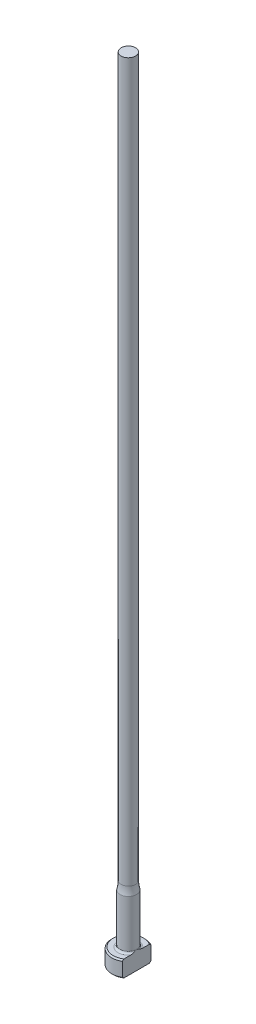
ISO-10303-21;
HEADER;
FILE_DESCRIPTION(('STEP AP214'),'2;1');
FILE_NAME('part.step','',(''),(''),'','','');
FILE_SCHEMA(('AUTOMOTIVE_DESIGN { 1 0 10303 214 1 1 1 1 }'));
ENDSEC;
DATA;
#1=APPLICATION_CONTEXT('core data for automotive mechanical design processes');
#2=APPLICATION_PROTOCOL_DEFINITION('international standard','automotive_design',2000,#1);
#3=PRODUCT_CONTEXT('',#1,'mechanical');
#4=PRODUCT('Part','Part','',(#3));
#5=PRODUCT_RELATED_PRODUCT_CATEGORY('part','',(#4));
#6=PRODUCT_DEFINITION_FORMATION('','',#4);
#7=PRODUCT_DEFINITION_CONTEXT('part definition',#1,'design');
#8=PRODUCT_DEFINITION('design','',#6,#7);
#9=PRODUCT_DEFINITION_SHAPE('','',#8);
#10=(LENGTH_UNIT() NAMED_UNIT(*) SI_UNIT(.MILLI.,.METRE.));
#11=(NAMED_UNIT(*) PLANE_ANGLE_UNIT() SI_UNIT($,.RADIAN.));
#12=(NAMED_UNIT(*) SI_UNIT($,.STERADIAN.) SOLID_ANGLE_UNIT());
#13=UNCERTAINTY_MEASURE_WITH_UNIT(LENGTH_MEASURE(1.E-05),#10,'distance_accuracy_value','');
#14=(GEOMETRIC_REPRESENTATION_CONTEXT(3) GLOBAL_UNCERTAINTY_ASSIGNED_CONTEXT((#13)) GLOBAL_UNIT_ASSIGNED_CONTEXT((#10,
#11,#12)) REPRESENTATION_CONTEXT('',''));
#15=CARTESIAN_POINT('',(0.,0.,0.));
#16=DIRECTION('',(0.,0.,1.));
#17=DIRECTION('',(1.,0.,0.));
#18=AXIS2_PLACEMENT_3D('',#15,#16,#17);
#19=CARTESIAN_POINT('',(-3.17499999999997,3.175,0.));
#20=DIRECTION('',(0.,1.,0.));
#21=DIRECTION('',(0.,0.,1.));
#22=AXIS2_PLACEMENT_3D('',#19,#20,#21);
#23=PLANE('',#22);
#24=CARTESIAN_POINT('',(0.,3.175,0.));
#25=DIRECTION('',(0.,1.,0.));
#26=DIRECTION('',(0.,0.,1.));
#27=AXIS2_PLACEMENT_3D('',#24,#25,#26);
#28=CIRCLE('',#27,2.92099999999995);
#29=CARTESIAN_POINT('',(1.58749999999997,3.175,-2.45195529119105));
#30=VERTEX_POINT('',#29);
#31=CARTESIAN_POINT('',(1.58749999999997,3.175,2.45195529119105));
#32=VERTEX_POINT('',#31);
#33=EDGE_CURVE('E105',#30,#32,#28,.T.);
#34=ORIENTED_EDGE('',*,*,#33,.T.);
#35=DIRECTION('',(0.,0.,1.));
#36=VECTOR('',#35,1.);
#37=CARTESIAN_POINT('',(1.58749999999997,3.17500000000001,2.74963065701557));
#38=LINE('',#37,#36);
#39=CARTESIAN_POINT('',(1.58749999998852,3.175,1.16397422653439));
#40=VERTEX_POINT('',#39);
#41=EDGE_CURVE('E126',#40,#32,#38,.T.);
#42=ORIENTED_EDGE('',*,*,#41,.F.);
#43=CARTESIAN_POINT('',(0.,3.175,0.));
#44=DIRECTION('',(0.,1.,0.));
#45=DIRECTION('',(0.,0.,1.));
#46=AXIS2_PLACEMENT_3D('',#43,#44,#45);
#47=CIRCLE('',#46,1.96849999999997);
#48=CARTESIAN_POINT('',(1.58749999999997,3.175,-1.16397422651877));
#49=VERTEX_POINT('',#48);
#50=EDGE_CURVE('E11',#40,#49,#47,.F.);
#51=ORIENTED_EDGE('',*,*,#50,.T.);
#52=EDGE_CURVE('E52',#30,#49,#38,.T.);
#53=ORIENTED_EDGE('',*,*,#52,.F.);
#54=EDGE_LOOP('',(#34,#42,#51,#53));
#55=FACE_BOUND('',#54,.T.);
#56=ADVANCED_FACE('F32',(#55),#23,.T.);
#57=CARTESIAN_POINT('',(0.,259.958771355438,0.));
#58=DIRECTION('',(0.,1.,0.));
#59=DIRECTION('',(0.,0.,1.));
#60=AXIS2_PLACEMENT_3D('',#57,#58,#59);
#61=CYLINDRICAL_SURFACE('',#60,3.17499999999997);
#62=CARTESIAN_POINT('',(0.,2.92100000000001,0.));
#63=DIRECTION('',(0.,1.,0.));
#64=DIRECTION('',(0.,0.,1.));
#65=AXIS2_PLACEMENT_3D('',#62,#63,#64);
#66=CIRCLE('',#65,3.17499999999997);
#67=CARTESIAN_POINT('',(1.58749999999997,2.92100000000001,2.74963065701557));
#68=VERTEX_POINT('',#67);
#69=CARTESIAN_POINT('',(1.58749999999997,2.92100000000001,-2.74963065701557));
#70=VERTEX_POINT('',#69);
#71=EDGE_CURVE('E98',#68,#70,#66,.F.);
#72=ORIENTED_EDGE('',*,*,#71,.T.);
#73=DIRECTION('',(0.,-1.,0.));
#74=VECTOR('',#73,1.);
#75=CARTESIAN_POINT('',(1.58749999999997,152.401,-2.74963065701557));
#76=LINE('',#75,#74);
#77=CARTESIAN_POINT('',(1.58749999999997,0.254000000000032,-2.74963065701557));
#78=VERTEX_POINT('',#77);
#79=EDGE_CURVE('E141',#70,#78,#76,.T.);
#80=ORIENTED_EDGE('',*,*,#79,.T.);
#81=CARTESIAN_POINT('',(0.,0.254000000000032,0.));
#82=DIRECTION('',(0.,-1.,0.));
#83=DIRECTION('',(0.,0.,-1.));
#84=AXIS2_PLACEMENT_3D('',#81,#82,#83);
#85=CIRCLE('',#84,3.17499999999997);
#86=CARTESIAN_POINT('',(1.58749999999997,0.254000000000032,2.74963065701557));
#87=VERTEX_POINT('',#86);
#88=EDGE_CURVE('E95',#78,#87,#85,.F.);
#89=ORIENTED_EDGE('',*,*,#88,.T.);
#90=DIRECTION('',(0.,-1.,0.));
#91=VECTOR('',#90,1.);
#92=CARTESIAN_POINT('',(1.58749999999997,152.401,2.74963065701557));
#93=LINE('',#92,#91);
#94=EDGE_CURVE('E88',#68,#87,#93,.T.);
#95=ORIENTED_EDGE('',*,*,#94,.F.);
#96=EDGE_LOOP('',(#72,#80,#89,#95));
#97=FACE_BOUND('',#96,.T.);
#98=ADVANCED_FACE('F191',(#97),#61,.T.);
#99=CARTESIAN_POINT('',(0.,0.,0.));
#100=DIRECTION('',(0.,-1.,0.));
#101=DIRECTION('',(0.,0.,-1.));
#102=AXIS2_PLACEMENT_3D('',#99,#100,#101);
#103=PLANE('',#102);
#104=CARTESIAN_POINT('',(0.,0.,0.));
#105=DIRECTION('',(0.,-1.,0.));
#106=DIRECTION('',(0.,0.,-1.));
#107=AXIS2_PLACEMENT_3D('',#104,#105,#106);
#108=CIRCLE('',#107,2.92099999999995);
#109=CARTESIAN_POINT('',(1.58749999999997,0.,2.45195529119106));
#110=VERTEX_POINT('',#109);
#111=CARTESIAN_POINT('',(1.58749999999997,0.,-2.45195529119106));
#112=VERTEX_POINT('',#111);
#113=EDGE_CURVE('E93',#110,#112,#108,.T.);
#114=ORIENTED_EDGE('',*,*,#113,.T.);
#115=DIRECTION('',(0.,0.,1.));
#116=VECTOR('',#115,1.);
#117=CARTESIAN_POINT('',(1.58749999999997,0.,2.74963065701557));
#118=LINE('',#117,#116);
#119=EDGE_CURVE('E78',#112,#110,#118,.T.);
#120=ORIENTED_EDGE('',*,*,#119,.T.);
#121=EDGE_LOOP('',(#114,#120));
#122=FACE_BOUND('',#121,.T.);
#123=ADVANCED_FACE('F97',(#122),#103,.T.);
#124=CARTESIAN_POINT('',(0.,3.17499999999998,0.));
#125=DIRECTION('',(0.,-1.,0.));
#126=DIRECTION('',(0.,0.,-1.));
#127=AXIS2_PLACEMENT_3D('',#124,#125,#126);
#128=CONICAL_SURFACE('',#127,2.92099999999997,0.7853981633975);
#129=ORIENTED_EDGE('',*,*,#71,.F.);
#130=CARTESIAN_POINT('',(1.58749999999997,-0.161620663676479,-6.0529050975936));
#131=CARTESIAN_POINT('',(1.58749999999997,-0.0288893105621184,-5.91567682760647));
#132=CARTESIAN_POINT('',(1.58749999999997,0.103699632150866,-5.77831035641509));
#133=CARTESIAN_POINT('',(1.58749999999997,0.36850839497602,-5.5032187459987));
#134=CARTESIAN_POINT('',(1.58749999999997,0.500728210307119,-5.36549360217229));
#135=CARTESIAN_POINT('',(1.58749999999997,0.764778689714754,-5.08953516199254));
#136=CARTESIAN_POINT('',(1.58749999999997,0.896609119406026,-4.95130164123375));
#137=CARTESIAN_POINT('',(1.58749999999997,1.15968706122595,-4.67428233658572));
#138=CARTESIAN_POINT('',(1.58749999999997,1.29093457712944,-4.53549655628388));
#139=CARTESIAN_POINT('',(1.58749999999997,1.55007705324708,-4.25997724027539));
#140=CARTESIAN_POINT('',(1.58749999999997,1.67798684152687,-4.12325766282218));
#141=CARTESIAN_POINT('',(1.58749999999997,1.93284861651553,-3.84892898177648));
#142=CARTESIAN_POINT('',(1.58749999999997,2.05980060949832,-3.71131988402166));
#143=CARTESIAN_POINT('',(1.58749999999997,2.31237508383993,-3.43493978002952));
#144=CARTESIAN_POINT('',(1.58749999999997,2.43799784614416,-3.29616903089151));
#145=CARTESIAN_POINT('',(1.58749999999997,2.68741369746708,-3.01699558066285));
#146=CARTESIAN_POINT('',(1.58749999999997,2.81120686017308,-2.87659294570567));
#147=CARTESIAN_POINT('',(1.58749999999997,3.0087586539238,-2.6481670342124));
#148=CARTESIAN_POINT('',(1.58749999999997,3.08336151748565,-2.56087478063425));
#149=CARTESIAN_POINT('',(1.58749999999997,3.23123871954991,-2.38515423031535));
#150=CARTESIAN_POINT('',(1.58749999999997,3.30451292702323,-2.29672582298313));
#151=CARTESIAN_POINT('',(1.58749999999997,3.45004422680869,-2.1174740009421));
#152=CARTESIAN_POINT('',(1.58749999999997,3.52228237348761,-2.02663514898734));
#153=CARTESIAN_POINT('',(1.58749999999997,3.6642309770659,-1.8430252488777));
#154=CARTESIAN_POINT('',(1.58749999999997,3.73394203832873,-1.75025467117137));
#155=CARTESIAN_POINT('',(1.58749999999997,3.87080633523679,-1.56067475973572));
#156=CARTESIAN_POINT('',(1.58749999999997,3.93790459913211,-1.46382547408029));
#157=CARTESIAN_POINT('',(1.58749999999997,4.06669147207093,-1.26632594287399));
#158=CARTESIAN_POINT('',(1.58749999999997,4.12837264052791,-1.16567073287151));
#159=CARTESIAN_POINT('',(1.58749999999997,4.2140225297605,-1.01165766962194));
#160=CARTESIAN_POINT('',(1.58749999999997,4.24127929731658,-0.960142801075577));
#161=CARTESIAN_POINT('',(1.58749999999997,4.29309798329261,-0.855780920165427));
#162=CARTESIAN_POINT('',(1.58749999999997,4.31765941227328,-0.802933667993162));
#163=CARTESIAN_POINT('',(1.58749999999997,4.38614656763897,-0.64246114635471));
#164=CARTESIAN_POINT('',(1.58749999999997,4.42510149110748,-0.532518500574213));
#165=CARTESIAN_POINT('',(1.58749999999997,4.46726244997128,-0.367680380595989));
#166=CARTESIAN_POINT('',(1.58749999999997,4.47844427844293,-0.314802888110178));
#167=CARTESIAN_POINT('',(1.58749999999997,4.495766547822,-0.2082097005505));
#168=CARTESIAN_POINT('',(1.58749999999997,4.50190743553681,-0.154494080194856));
#169=CARTESIAN_POINT('',(1.58749999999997,4.50871296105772,-0.0468792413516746));
#170=CARTESIAN_POINT('',(1.58749999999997,4.50939451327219,0.0070188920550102));
#171=CARTESIAN_POINT('',(1.58749999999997,4.50527679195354,0.114606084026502));
#172=CARTESIAN_POINT('',(1.58749999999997,4.50047706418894,0.168295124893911));
#173=CARTESIAN_POINT('',(1.58749999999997,4.48579689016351,0.274485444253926));
#174=CARTESIAN_POINT('',(1.58749999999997,4.47596081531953,0.326992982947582));
#175=CARTESIAN_POINT('',(1.58749999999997,4.45181809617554,0.430974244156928));
#176=CARTESIAN_POINT('',(1.58749999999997,4.43750969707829,0.48244755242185));
#177=CARTESIAN_POINT('',(1.58749999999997,4.40502489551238,0.584460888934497));
#178=CARTESIAN_POINT('',(1.58749999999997,4.38682724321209,0.634994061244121));
#179=CARTESIAN_POINT('',(1.58749999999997,4.34729308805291,0.734789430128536));
#180=CARTESIAN_POINT('',(1.58749999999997,4.32595722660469,0.784051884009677));
#181=CARTESIAN_POINT('',(1.58749999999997,4.25791922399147,0.930549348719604));
#182=CARTESIAN_POINT('',(1.58749999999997,4.20736047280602,1.02598802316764));
#183=CARTESIAN_POINT('',(1.58749999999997,4.09955451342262,1.2130431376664));
#184=CARTESIAN_POINT('',(1.58749999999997,4.04229912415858,1.30465471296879));
#185=CARTESIAN_POINT('',(1.58749999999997,3.9230874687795,1.4852621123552));
#186=CARTESIAN_POINT('',(1.58749999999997,3.86111349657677,1.57424615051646));
#187=CARTESIAN_POINT('',(1.58749999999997,3.73408621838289,1.74990003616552));
#188=CARTESIAN_POINT('',(1.58749999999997,3.66903444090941,1.8365709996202));
#189=CARTESIAN_POINT('',(1.58749999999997,3.53583371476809,2.00931764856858));
#190=CARTESIAN_POINT('',(1.58749999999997,3.46765527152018,2.09537048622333));
#191=CARTESIAN_POINT('',(1.58749999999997,3.32960643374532,2.26611736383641));
#192=CARTESIAN_POINT('',(1.58749999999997,3.25973586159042,2.35081125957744));
#193=CARTESIAN_POINT('',(1.58749999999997,3.04858139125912,2.60290121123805));
#194=CARTESIAN_POINT('',(1.58749999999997,2.90542388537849,2.76872537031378));
#195=CARTESIAN_POINT('',(1.58749999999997,2.64069522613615,3.06970913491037));
#196=CARTESIAN_POINT('',(1.58749999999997,2.5195945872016,3.20528660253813));
#197=CARTESIAN_POINT('',(1.58749999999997,2.275904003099,3.47510321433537));
#198=CARTESIAN_POINT('',(1.58749999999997,2.15331401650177,3.60934232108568));
#199=CARTESIAN_POINT('',(1.58749999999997,1.90694239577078,3.87695374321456));
#200=CARTESIAN_POINT('',(1.58749999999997,1.78315974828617,4.01032512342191));
#201=CARTESIAN_POINT('',(1.58749999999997,1.53478104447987,4.2763088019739));
#202=CARTESIAN_POINT('',(1.58749999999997,1.41018498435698,4.40892109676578));
#203=CARTESIAN_POINT('',(1.58749999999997,1.0457468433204,4.79499418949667));
#204=CARTESIAN_POINT('',(1.58749999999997,0.805076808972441,5.04767313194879));
#205=CARTESIAN_POINT('',(1.58749999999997,0.443121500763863,5.42550911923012));
#206=CARTESIAN_POINT('',(1.58749999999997,0.322378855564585,5.55118772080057));
#207=CARTESIAN_POINT('',(1.58749999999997,0.0805914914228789,5.80225207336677));
#208=CARTESIAN_POINT('',(1.58749999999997,-0.0404532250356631,5.92763782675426));
#209=CARTESIAN_POINT('',(1.58749999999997,-0.161620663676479,6.0529050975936));
#210=B_SPLINE_CURVE_WITH_KNOTS('',3,(#130,#131,#132,#133,#134,#135,#136,#137,#138,#139,#140,
#141,#142,#143,#144,#145,#146,#147,#148,#149,#150,#151,#152,#153,#154,#155,#156,#157,#158,#159,
#160,#161,#162,#163,#164,#165,#166,#167,#168,#169,#170,#171,#172,#173,#174,#175,#176,#177,#178,
#179,#180,#181,#182,#183,#184,#185,#186,#187,#188,#189,#190,#191,#192,#193,#194,#195,#196,#197,
#198,#199,#200,#201,#202,#203,#204,#205,#206,#207,#208,#209),.UNSPECIFIED.,.F.,.F.,(4,2,2,2,2,2,
2,2,2,2,2,2,2,2,2,2,2,2,2,2,2,2,2,2,2,2,2,2,2,2,2,2,2,2,2,2,2,2,2,4),(0.,0.572750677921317,
1.14550874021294,1.71856057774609,2.29160869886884,2.85328006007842,3.41494773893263,
3.97649423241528,4.53801804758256,4.88249307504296,5.22700189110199,5.57515326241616,
5.92322081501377,6.27657800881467,6.63041319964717,6.80518126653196,6.97998101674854,
7.32824262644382,7.49018491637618,7.65211285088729,7.813538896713,7.97497832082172,
8.13501929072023,8.29512313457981,8.4561251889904,8.61709438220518,8.94062993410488,
9.26456495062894,9.58978187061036,9.91483894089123,10.2441741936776,10.5735441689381,
11.2306812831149,11.7760337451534,12.3214014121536,12.8672825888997,13.4131663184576,
14.4600164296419,14.9828595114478,15.505698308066),.UNSPECIFIED.);
#211=EDGE_CURVE('E118',#32,#68,#210,.T.);
#212=ORIENTED_EDGE('',*,*,#211,.F.);
#213=ORIENTED_EDGE('',*,*,#33,.F.);
#214=EDGE_CURVE('E117',#70,#30,#210,.T.);
#215=ORIENTED_EDGE('',*,*,#214,.F.);
#216=EDGE_LOOP('',(#129,#212,#213,#215));
#217=FACE_BOUND('',#216,.T.);
#218=ADVANCED_FACE('F162',(#217),#128,.T.);
#219=CARTESIAN_POINT('',(0.,0.254000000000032,0.));
#220=DIRECTION('',(0.,1.,0.));
#221=DIRECTION('',(0.,0.,1.));
#222=AXIS2_PLACEMENT_3D('',#219,#220,#221);
#223=CONICAL_SURFACE('',#222,3.17499999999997,0.785398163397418);
#224=ORIENTED_EDGE('',*,*,#88,.F.);
#225=CARTESIAN_POINT('',(1.58749999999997,3.33662066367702,6.0529050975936));
#226=CARTESIAN_POINT('',(1.58749999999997,3.20388931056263,5.91567682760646));
#227=CARTESIAN_POINT('',(1.58749999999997,3.0713003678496,5.77831035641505));
#228=CARTESIAN_POINT('',(1.58749999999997,2.80649160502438,5.50321874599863));
#229=CARTESIAN_POINT('',(1.58749999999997,2.67427178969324,5.36549360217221));
#230=CARTESIAN_POINT('',(1.58749999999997,2.41022131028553,5.08953516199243));
#231=CARTESIAN_POINT('',(1.58749999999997,2.27839088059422,4.95130164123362));
#232=CARTESIAN_POINT('',(1.58749999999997,2.01531293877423,4.67428233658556));
#233=CARTESIAN_POINT('',(1.58749999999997,1.8840654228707,4.5354965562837));
#234=CARTESIAN_POINT('',(1.58749999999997,1.62492294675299,4.25997724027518));
#235=CARTESIAN_POINT('',(1.58749999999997,1.49701315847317,4.12325766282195));
#236=CARTESIAN_POINT('',(1.58749999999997,1.24215138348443,3.84892898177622));
#237=CARTESIAN_POINT('',(1.58749999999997,1.11519939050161,3.71131988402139));
#238=CARTESIAN_POINT('',(1.58749999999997,0.862624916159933,3.43493978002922));
#239=CARTESIAN_POINT('',(1.58749999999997,0.737002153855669,3.29616903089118));
#240=CARTESIAN_POINT('',(1.58749999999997,0.487586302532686,3.01699558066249));
#241=CARTESIAN_POINT('',(1.58749999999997,0.363793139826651,2.8765929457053));
#242=CARTESIAN_POINT('',(1.58749999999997,0.1662413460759,2.64816703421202));
#243=CARTESIAN_POINT('',(1.58749999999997,0.0916384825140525,2.56087478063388));
#244=CARTESIAN_POINT('',(1.58749999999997,-0.0562387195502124,2.385154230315));
#245=CARTESIAN_POINT('',(1.58749999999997,-0.129512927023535,2.29672582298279));
#246=CARTESIAN_POINT('',(1.58749999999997,-0.275044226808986,2.11747400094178));
#247=CARTESIAN_POINT('',(1.58749999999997,-0.34728237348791,2.02663514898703));
#248=CARTESIAN_POINT('',(1.58749999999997,-0.489230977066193,1.84302524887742));
#249=CARTESIAN_POINT('',(1.58749999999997,-0.558942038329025,1.75025467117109));
#250=CARTESIAN_POINT('',(1.58749999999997,-0.695806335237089,1.56067475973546));
#251=CARTESIAN_POINT('',(1.58749999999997,-0.762904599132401,1.46382547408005));
#252=CARTESIAN_POINT('',(1.58749999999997,-0.89169147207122,1.26632594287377));
#253=CARTESIAN_POINT('',(1.58749999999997,-0.953372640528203,1.16567073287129));
#254=CARTESIAN_POINT('',(1.58749999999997,-1.03902252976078,1.01165766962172));
#255=CARTESIAN_POINT('',(1.58749999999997,-1.06627929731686,0.960142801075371));
#256=CARTESIAN_POINT('',(1.58749999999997,-1.11809798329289,0.855780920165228));
#257=CARTESIAN_POINT('',(1.58749999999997,-1.14265941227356,0.802933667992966));
#258=CARTESIAN_POINT('',(1.58749999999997,-1.21114656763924,0.642461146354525));
#259=CARTESIAN_POINT('',(1.58749999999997,-1.25010149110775,0.532518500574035));
#260=CARTESIAN_POINT('',(1.58749999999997,-1.29226244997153,0.36768038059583));
#261=CARTESIAN_POINT('',(1.58749999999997,-1.30344427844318,0.31480288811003));
#262=CARTESIAN_POINT('',(1.58749999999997,-1.32076654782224,0.208209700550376));
#263=CARTESIAN_POINT('',(1.58749999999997,-1.32690743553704,0.154494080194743));
#264=CARTESIAN_POINT('',(1.58749999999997,-1.33371296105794,0.0468792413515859));
#265=CARTESIAN_POINT('',(1.58749999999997,-1.33439451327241,-0.0070188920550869));
#266=CARTESIAN_POINT('',(1.58749999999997,-1.33027679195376,-0.114606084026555));
#267=CARTESIAN_POINT('',(1.58749999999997,-1.32547706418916,-0.168295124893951));
#268=CARTESIAN_POINT('',(1.58749999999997,-1.31079689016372,-0.274485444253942));
#269=CARTESIAN_POINT('',(1.58749999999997,-1.30096081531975,-0.326992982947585));
#270=CARTESIAN_POINT('',(1.58749999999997,-1.27681809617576,-0.430974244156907));
#271=CARTESIAN_POINT('',(1.58749999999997,-1.26250969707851,-0.482447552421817));
#272=CARTESIAN_POINT('',(1.58749999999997,-1.2300248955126,-0.584460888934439));
#273=CARTESIAN_POINT('',(1.58749999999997,-1.21182724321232,-0.634994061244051));
#274=CARTESIAN_POINT('',(1.58749999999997,-1.17229308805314,-0.734789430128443));
#275=CARTESIAN_POINT('',(1.58749999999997,-1.15095722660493,-0.784051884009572));
#276=CARTESIAN_POINT('',(1.58749999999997,-1.08291922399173,-0.93054934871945));
#277=CARTESIAN_POINT('',(1.58749999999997,-1.0323604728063,-1.02598802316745));
#278=CARTESIAN_POINT('',(1.58749999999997,-0.92455451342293,-1.21304313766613));
#279=CARTESIAN_POINT('',(1.58749999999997,-0.867299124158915,-1.30465471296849));
#280=CARTESIAN_POINT('',(1.58749999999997,-0.748087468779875,-1.48526211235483));
#281=CARTESIAN_POINT('',(1.58749999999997,-0.686113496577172,-1.57424615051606));
#282=CARTESIAN_POINT('',(1.58749999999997,-0.559086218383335,-1.74990003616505));
#283=CARTESIAN_POINT('',(1.58749999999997,-0.494034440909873,-1.83657099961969));
#284=CARTESIAN_POINT('',(1.58749999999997,-0.360833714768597,-2.00931764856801));
#285=CARTESIAN_POINT('',(1.58749999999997,-0.292655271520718,-2.09537048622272));
#286=CARTESIAN_POINT('',(1.58749999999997,-0.154606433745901,-2.26611736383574));
#287=CARTESIAN_POINT('',(1.58749999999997,-0.084735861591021,-2.35081125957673));
#288=CARTESIAN_POINT('',(1.58749999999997,0.126418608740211,-2.60290121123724));
#289=CARTESIAN_POINT('',(1.58749999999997,0.26957611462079,-2.76872537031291));
#290=CARTESIAN_POINT('',(1.58749999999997,0.534304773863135,-3.06970913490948));
#291=CARTESIAN_POINT('',(1.58749999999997,0.655405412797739,-3.20528660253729));
#292=CARTESIAN_POINT('',(1.58749999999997,0.899095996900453,-3.47510321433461));
#293=CARTESIAN_POINT('',(1.58749999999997,1.02168598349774,-3.60934232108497));
#294=CARTESIAN_POINT('',(1.58749999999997,1.26805760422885,-3.87695374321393));
#295=CARTESIAN_POINT('',(1.58749999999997,1.39184025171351,-4.01032512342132));
#296=CARTESIAN_POINT('',(1.58749999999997,1.64021895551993,-4.2763088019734));
#297=CARTESIAN_POINT('',(1.58749999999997,1.76481501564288,-4.40892109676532));
#298=CARTESIAN_POINT('',(1.58749999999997,2.12925315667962,-4.79499418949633));
#299=CARTESIAN_POINT('',(1.58749999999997,2.36992319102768,-5.04767313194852));
#300=CARTESIAN_POINT('',(1.58749999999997,2.73187849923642,-5.42550911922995));
#301=CARTESIAN_POINT('',(1.58749999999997,2.85262114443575,-5.55118772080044));
#302=CARTESIAN_POINT('',(1.58749999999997,3.09440850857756,-5.8022520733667));
#303=CARTESIAN_POINT('',(1.58749999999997,3.21545322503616,-5.92763782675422));
#304=CARTESIAN_POINT('',(1.58749999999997,3.33662066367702,-6.0529050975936));
#305=B_SPLINE_CURVE_WITH_KNOTS('',3,(#225,#226,#227,#228,#229,#230,#231,#232,#233,#234,#235,
#236,#237,#238,#239,#240,#241,#242,#243,#244,#245,#246,#247,#248,#249,#250,#251,#252,#253,#254,
#255,#256,#257,#258,#259,#260,#261,#262,#263,#264,#265,#266,#267,#268,#269,#270,#271,#272,#273,
#274,#275,#276,#277,#278,#279,#280,#281,#282,#283,#284,#285,#286,#287,#288,#289,#290,#291,#292,
#293,#294,#295,#296,#297,#298,#299,#300,#301,#302,#303,#304),.UNSPECIFIED.,.F.,.F.,(4,2,2,2,2,2,
2,2,2,2,2,2,2,2,2,2,2,2,2,2,2,2,2,2,2,2,2,2,2,2,2,2,2,2,2,2,2,2,2,4),(0.,0.572750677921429,
1.14550874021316,1.71856057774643,2.29160869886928,2.85328006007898,3.41494773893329,
3.97649423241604,4.53801804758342,4.8824930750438,5.22700189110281,5.57515326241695,
5.92322081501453,6.27657800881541,6.63041319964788,6.80518126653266,6.97998101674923,
7.32824262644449,7.49018491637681,7.65211285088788,7.81353889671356,7.97497832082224,
8.13501929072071,8.29512313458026,8.45612518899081,8.61709438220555,8.94062993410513,
9.26456495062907,9.58978187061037,9.91483894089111,10.2441741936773,10.5735441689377,
11.2306812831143,11.776033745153,12.3214014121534,12.8672825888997,13.4131663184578,
14.4600164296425,14.9828595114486,15.505698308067),.UNSPECIFIED.);
#306=EDGE_CURVE('E81',#112,#78,#305,.T.);
#307=ORIENTED_EDGE('',*,*,#306,.F.);
#308=ORIENTED_EDGE('',*,*,#113,.F.);
#309=EDGE_CURVE('E84',#87,#110,#305,.T.);
#310=ORIENTED_EDGE('',*,*,#309,.F.);
#311=EDGE_LOOP('',(#224,#307,#308,#310));
#312=FACE_BOUND('',#311,.T.);
#313=ADVANCED_FACE('F92',(#312),#223,.T.);
#314=CARTESIAN_POINT('',(0.,3.556,0.));
#315=DIRECTION('',(0.,1.,0.));
#316=DIRECTION('',(0.,0.,1.));
#317=AXIS2_PLACEMENT_3D('',#314,#315,#316);
#318=TOROIDAL_SURFACE('',#317,1.96849999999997,0.381);
#319=CARTESIAN_POINT('',(1.58749999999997,3.556,0.));
#320=CARTESIAN_POINT('',(1.58749999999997,3.55599928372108,-9.72839998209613E-12));
#321=CARTESIAN_POINT('',(1.58749999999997,3.55599856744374,-1.16390048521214E-07));
#322=CARTESIAN_POINT('',(1.58749999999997,3.55599717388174,-5.02802253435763E-07));
#323=CARTESIAN_POINT('',(1.58749999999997,3.55599649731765,-7.75049116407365E-07));
#324=CARTESIAN_POINT('',(1.58749999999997,3.55599515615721,-1.43578185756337E-06));
#325=CARTESIAN_POINT('',(1.58749999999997,3.55599449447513,-1.83004116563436E-06));
#326=CARTESIAN_POINT('',(1.58749999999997,3.55599322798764,-2.69326525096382E-06));
#327=CARTESIAN_POINT('',(1.58749999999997,3.55599262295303,-3.16190628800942E-06));
#328=CARTESIAN_POINT('',(1.58749999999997,3.55599066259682,-4.80183833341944E-06));
#329=CARTESIAN_POINT('',(1.58749999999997,3.55598938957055,-6.07237548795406E-06));
#330=CARTESIAN_POINT('',(1.58749999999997,3.55598706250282,-8.74131694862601E-06));
#331=CARTESIAN_POINT('',(1.58749999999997,3.55598600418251,-1.01362054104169E-05));
#332=CARTESIAN_POINT('',(1.58749999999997,3.55598220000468,-1.54025644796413E-05));
#333=CARTESIAN_POINT('',(1.58749999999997,3.55597966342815,-1.94297992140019E-05));
#334=CARTESIAN_POINT('',(1.58749999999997,3.55597535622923,-2.75116574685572E-05));
#335=CARTESIAN_POINT('',(1.58749999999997,3.55597354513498,-3.15456374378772E-05));
#336=CARTESIAN_POINT('',(1.58749999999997,3.55596616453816,-4.82039076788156E-05));
#337=CARTESIAN_POINT('',(1.58749999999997,3.55596077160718,-6.08993138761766E-05));
#338=CARTESIAN_POINT('',(1.58749999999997,3.55595181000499,-8.49758225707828E-05));
#339=CARTESIAN_POINT('',(1.58749999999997,3.55594809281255,-9.6299831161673E-05));
#340=CARTESIAN_POINT('',(1.58749999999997,3.55591954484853,-0.000176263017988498));
#341=CARTESIAN_POINT('',(1.58749999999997,3.55588430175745,-0.000240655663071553));
#342=CARTESIAN_POINT('',(1.58749999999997,3.55575419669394,-0.000487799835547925));
#343=CARTESIAN_POINT('',(1.58749999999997,3.55566706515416,-0.000673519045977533));
#344=CARTESIAN_POINT('',(1.58749999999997,3.55532896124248,-0.00138308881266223));
#345=CARTESIAN_POINT('',(1.58749999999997,3.55506990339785,-0.0019038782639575));
#346=CARTESIAN_POINT('',(1.58749999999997,3.55403272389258,-0.00399959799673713));
#347=CARTESIAN_POINT('',(1.58749999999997,3.55326363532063,-0.0055779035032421));
#348=CARTESIAN_POINT('',(1.58749999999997,3.53734419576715,-0.0382341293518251));
#349=CARTESIAN_POINT('',(1.58749999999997,3.52209124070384,-0.0692744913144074));
#350=CARTESIAN_POINT('',(1.58749999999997,3.49234031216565,-0.130397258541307));
#351=CARTESIAN_POINT('',(1.58749999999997,3.4778343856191,-0.160476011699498));
#352=CARTESIAN_POINT('',(1.58749999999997,3.44756579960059,-0.22405302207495));
#353=CARTESIAN_POINT('',(1.58749999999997,3.43183768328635,-0.257567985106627));
#354=CARTESIAN_POINT('',(1.58749999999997,3.40084315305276,-0.325196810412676));
#355=CARTESIAN_POINT('',(1.58749999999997,3.38558252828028,-0.359313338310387));
#356=CARTESIAN_POINT('',(1.58749999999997,3.35947844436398,-0.419670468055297));
#357=CARTESIAN_POINT('',(1.58749999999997,3.34845502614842,-0.445832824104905));
#358=CARTESIAN_POINT('',(1.58749999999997,3.32703860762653,-0.498343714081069));
#359=CARTESIAN_POINT('',(1.58749999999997,3.31664422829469,-0.52469168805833));
#360=CARTESIAN_POINT('',(1.58749999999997,3.2869407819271,-0.603098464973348));
#361=CARTESIAN_POINT('',(1.58749999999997,3.26865317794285,-0.655557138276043));
#362=CARTESIAN_POINT('',(1.58749999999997,3.24332469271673,-0.737608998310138));
#363=CARTESIAN_POINT('',(1.58749999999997,3.23494346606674,-0.766787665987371));
#364=CARTESIAN_POINT('',(1.58749999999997,3.21949479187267,-0.825628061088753));
#365=CARTESIAN_POINT('',(1.58749999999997,3.21243348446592,-0.855291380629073));
#366=CARTESIAN_POINT('',(1.58749999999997,3.19303275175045,-0.947623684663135));
#367=CARTESIAN_POINT('',(1.58749999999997,3.18336484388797,-1.01091582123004));
#368=CARTESIAN_POINT('',(1.58749999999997,3.17464826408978,-1.12491727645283));
#369=CARTESIAN_POINT('',(1.58749999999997,3.17379742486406,-1.17548103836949));
#370=CARTESIAN_POINT('',(1.58749999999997,3.17980825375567,-1.2756075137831));
#371=CARTESIAN_POINT('',(1.58749999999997,3.18656467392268,-1.32517446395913));
#372=CARTESIAN_POINT('',(1.58749999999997,3.20510062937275,-1.40268723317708));
#373=CARTESIAN_POINT('',(1.58749999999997,3.21379930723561,-1.43136704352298));
#374=CARTESIAN_POINT('',(1.58749999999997,3.23523847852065,-1.48727388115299));
#375=CARTESIAN_POINT('',(1.58749999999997,3.24798385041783,-1.51449910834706));
#376=CARTESIAN_POINT('',(1.58749999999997,3.27479889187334,-1.56082978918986));
#377=CARTESIAN_POINT('',(1.58749999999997,3.2880084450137,-1.5804296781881));
#378=CARTESIAN_POINT('',(1.58749999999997,3.31738741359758,-1.61726850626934));
#379=CARTESIAN_POINT('',(1.58749999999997,3.33355126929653,-1.63451177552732));
#380=CARTESIAN_POINT('',(1.58749999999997,3.3650209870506,-1.66235366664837));
#381=CARTESIAN_POINT('',(1.58749999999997,3.37976591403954,-1.67358404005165));
#382=CARTESIAN_POINT('',(1.58749999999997,3.41090649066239,-1.69348690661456));
#383=CARTESIAN_POINT('',(1.58749999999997,3.42730148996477,-1.70216040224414));
#384=CARTESIAN_POINT('',(1.58749999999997,3.46152587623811,-1.71647536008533));
#385=CARTESIAN_POINT('',(1.58749999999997,3.47936500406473,-1.72209384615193));
#386=CARTESIAN_POINT('',(1.58749999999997,3.51579449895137,-1.72977101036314));
#387=CARTESIAN_POINT('',(1.58749999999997,3.53438431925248,-1.73183223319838));
#388=CARTESIAN_POINT('',(1.58749999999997,3.5693049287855,-1.73220894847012));
#389=CARTESIAN_POINT('',(1.58749999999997,3.58563247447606,-1.73095378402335));
#390=CARTESIAN_POINT('',(1.58749999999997,3.61782719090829,-1.72566824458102));
#391=CARTESIAN_POINT('',(1.58749999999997,3.6336944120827,-1.72163817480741));
#392=CARTESIAN_POINT('',(1.58749999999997,3.66430913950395,-1.71112762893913));
#393=CARTESIAN_POINT('',(1.58749999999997,3.67907021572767,-1.70468621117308));
#394=CARTESIAN_POINT('',(1.58749999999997,3.7074589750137,-1.68967506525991));
#395=CARTESIAN_POINT('',(1.58749999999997,3.72108625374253,-1.68110458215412));
#396=CARTESIAN_POINT('',(1.58749999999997,3.75190835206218,-1.6586320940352));
#397=CARTESIAN_POINT('',(1.58749999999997,3.76852524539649,-1.64393589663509));
#398=CARTESIAN_POINT('',(1.58749999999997,3.79915076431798,-1.61203006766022));
#399=CARTESIAN_POINT('',(1.58749999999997,3.81315342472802,-1.59481484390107));
#400=CARTESIAN_POINT('',(1.58749999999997,3.84335302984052,-1.55180967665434));
#401=CARTESIAN_POINT('',(1.58749999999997,3.85840997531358,-1.52522183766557));
#402=CARTESIAN_POINT('',(1.58749999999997,3.8840928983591,-1.47008223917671));
#403=CARTESIAN_POINT('',(1.58749999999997,3.89472145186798,-1.44153163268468));
#404=CARTESIAN_POINT('',(1.58749999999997,3.91656912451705,-1.36850699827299));
#405=CARTESIAN_POINT('',(1.58749999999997,3.92534811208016,-1.32330828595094));
#406=CARTESIAN_POINT('',(1.58749999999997,3.93598980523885,-1.23163561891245));
#407=CARTESIAN_POINT('',(1.58749999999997,3.93776012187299,-1.18515271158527));
#408=CARTESIAN_POINT('',(1.58749999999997,3.93485724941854,-1.056626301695));
#409=CARTESIAN_POINT('',(1.58749999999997,3.9241811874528,-0.974728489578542));
#410=CARTESIAN_POINT('',(1.58749999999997,3.899893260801,-0.855941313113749));
#411=CARTESIAN_POINT('',(1.58749999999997,3.89075037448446,-0.817952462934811));
#412=CARTESIAN_POINT('',(1.58749999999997,3.87034922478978,-0.742758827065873));
#413=CARTESIAN_POINT('',(1.58749999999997,3.85910312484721,-0.705550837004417));
#414=CARTESIAN_POINT('',(1.58749999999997,3.83067738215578,-0.618900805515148));
#415=CARTESIAN_POINT('',(1.58749999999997,3.81279292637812,-0.56969368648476));
#416=CARTESIAN_POINT('',(1.58749999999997,3.78404415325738,-0.496059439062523));
#417=CARTESIAN_POINT('',(1.58749999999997,3.77402894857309,-0.471293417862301));
#418=CARTESIAN_POINT('',(1.58749999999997,3.75347166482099,-0.421913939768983));
#419=CARTESIAN_POINT('',(1.58749999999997,3.74292842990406,-0.39730096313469));
#420=CARTESIAN_POINT('',(1.58749999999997,3.71797467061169,-0.340371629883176));
#421=CARTESIAN_POINT('',(1.58749999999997,3.7034106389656,-0.308122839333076));
#422=CARTESIAN_POINT('',(1.58749999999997,3.67389634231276,-0.244169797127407));
#423=CARTESIAN_POINT('',(1.58749999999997,3.65895097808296,-0.212463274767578));
#424=CARTESIAN_POINT('',(1.58749999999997,3.63022587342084,-0.152300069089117));
#425=CARTESIAN_POINT('',(1.58749999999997,3.61647532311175,-0.123829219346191));
#426=CARTESIAN_POINT('',(1.58749999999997,3.58829058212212,-0.065967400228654));
#427=CARTESIAN_POINT('',(1.58749999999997,3.57384944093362,-0.036579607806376));
#428=CARTESIAN_POINT('',(1.58749999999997,3.55873641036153,-0.00557801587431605));
#429=CARTESIAN_POINT('',(1.58749999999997,3.557967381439,-0.00399981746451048));
#430=CARTESIAN_POINT('',(1.58749999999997,3.55693021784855,-0.00190412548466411));
#431=CARTESIAN_POINT('',(1.58749999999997,3.55667111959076,-0.00138325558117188));
#432=CARTESIAN_POINT('',(1.58749999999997,3.55633296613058,-0.00067358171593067));
#433=CARTESIAN_POINT('',(1.58749999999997,3.55624582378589,-0.000487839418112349));
#434=CARTESIAN_POINT('',(1.58749999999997,3.55611570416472,-0.000240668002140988));
#435=CARTESIAN_POINT('',(1.58749999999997,3.55608045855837,-0.000176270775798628));
#436=CARTESIAN_POINT('',(1.58749999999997,3.55605190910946,-9.63021903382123E-05));
#437=CARTESIAN_POINT('',(1.58749999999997,3.55604819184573,-8.49777827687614E-05));
#438=CARTESIAN_POINT('',(1.58749999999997,3.55603922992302,-6.09004217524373E-05));
#439=CARTESIAN_POINT('',(1.58749999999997,3.55603383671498,-4.82045726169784E-05));
#440=CARTESIAN_POINT('',(1.58749999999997,3.55602645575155,-3.15458034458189E-05));
#441=CARTESIAN_POINT('',(1.58749999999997,3.55602464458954,-2.75117552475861E-05));
#442=CARTESIAN_POINT('',(1.58749999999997,3.55602033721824,-1.94297725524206E-05));
#443=CARTESIAN_POINT('',(1.58749999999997,3.55601780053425,-1.54024835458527E-05));
#444=CARTESIAN_POINT('',(1.58749999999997,3.55601399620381,-1.01360754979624E-05));
#445=CARTESIAN_POINT('',(1.58749999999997,3.55601293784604,-8.7411813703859E-06));
#446=CARTESIAN_POINT('',(1.58749999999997,3.55601061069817,-6.07223627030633E-06));
#447=CARTESIAN_POINT('',(1.58749999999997,3.55600933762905,-4.80170138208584E-06));
#448=CARTESIAN_POINT('',(1.58749999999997,3.55600737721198,-3.16178168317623E-06));
#449=CARTESIAN_POINT('',(1.58749999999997,3.55600677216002,-2.69314602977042E-06));
#450=CARTESIAN_POINT('',(1.58749999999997,3.55600550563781,-1.82993577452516E-06));
#451=CARTESIAN_POINT('',(1.58749999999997,3.55600484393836,-1.43568493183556E-06));
#452=CARTESIAN_POINT('',(1.58749999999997,3.55600350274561,-7.74972790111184E-07));
#453=CARTESIAN_POINT('',(1.58749999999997,3.55600282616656,-5.02737772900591E-07));
#454=CARTESIAN_POINT('',(1.58749999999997,3.55600143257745,-1.16354060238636E-07));
#455=CARTESIAN_POINT('',(1.58749999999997,3.55600071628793,9.72852226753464E-12));
#456=CARTESIAN_POINT('',(1.58749999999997,3.556,0.));
#457=B_SPLINE_CURVE_WITH_KNOTS('',3,(#319,#320,#321,#322,#323,#324,#325,#326,#327,#328,#329,
#330,#331,#332,#333,#334,#335,#336,#337,#338,#339,#340,#341,#342,#343,#344,#345,#346,#347,#348,
#349,#350,#351,#352,#353,#354,#355,#356,#357,#358,#359,#360,#361,#362,#363,#364,#365,#366,#367,
#368,#369,#370,#371,#372,#373,#374,#375,#376,#377,#378,#379,#380,#381,#382,#383,#384,#385,#386,
#387,#388,#389,#390,#391,#392,#393,#394,#395,#396,#397,#398,#399,#400,#401,#402,#403,#404,#405,
#406,#407,#408,#409,#410,#411,#412,#413,#414,#415,#416,#417,#418,#419,#420,#421,#422,#423,#424,
#425,#426,#427,#428,#429,#430,#431,#432,#433,#434,#435,#436,#437,#438,#439,#440,#441,#442,#443,
#444,#445,#446,#447,#448,#449,#450,#451,#452,#453,#454,#455,#456),.UNSPECIFIED.,.T.,.F.,(4,2,2,
2,2,2,2,2,2,2,2,2,2,2,2,2,2,2,2,2,2,2,2,2,2,2,2,2,2,2,2,2,2,2,2,2,2,2,2,2,2,2,2,2,2,2,2,2,2,2,2,
2,2,2,2,2,2,2,2,2,2,2,2,2,2,2,2,2,4),(0.,2.14653634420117E-06,4.3243617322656E-06,
6.62715069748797E-06,8.92017875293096E-06,1.42892293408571E-05,1.95376032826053E-05,
3.37616071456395E-05,4.70144492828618E-05,8.83789092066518E-05,0.000124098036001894,
0.000343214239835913,0.000959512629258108,0.00270343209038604,0.00797166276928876,
0.11171345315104,0.21189766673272,0.322958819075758,0.435072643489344,0.520234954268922,
0.605203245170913,0.771741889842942,0.862787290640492,0.954246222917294,1.14571222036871,
1.29701464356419,1.44624921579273,1.53592478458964,1.62570887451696,1.69637166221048,
1.76690281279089,1.82229027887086,1.87765600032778,1.93343255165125,1.98916918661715,
2.03805361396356,2.08693266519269,2.13505202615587,2.18318847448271,2.24937187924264,
2.31570450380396,2.4068617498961,2.49796589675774,2.63532677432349,2.77449244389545,
3.02069049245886,3.13789423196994,3.25444001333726,3.41142684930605,3.491566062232,
3.57188909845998,3.67803747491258,3.78319074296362,3.87804579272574,3.97626481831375,
3.98153268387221,3.98327687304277,3.98389324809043,3.98411237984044,3.98414810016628,
3.98418946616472,3.98420271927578,3.98421694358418,3.98422219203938,3.9842275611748,
3.98422985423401,3.98423215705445,3.98423433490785,3.98423648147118),.UNSPECIFIED.);
#458=CARTESIAN_POINT('',(1.58749999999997,3.556,0.));
#459=VERTEX_POINT('',#458);
#460=EDGE_CURVE('E47',#459,#49,#457,.T.);
#461=ORIENTED_EDGE('',*,*,#460,.T.);
#462=ORIENTED_EDGE('',*,*,#50,.F.);
#463=CARTESIAN_POINT('',(1.58749999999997,3.556,0.));
#464=CARTESIAN_POINT('',(1.58749999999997,3.55600071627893,9.72842792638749E-12));
#465=CARTESIAN_POINT('',(1.58749999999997,3.55600143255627,1.16390048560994E-07));
#466=CARTESIAN_POINT('',(1.58749999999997,3.55600282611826,5.02802253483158E-07));
#467=CARTESIAN_POINT('',(1.58749999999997,3.55600350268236,7.7504911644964E-07));
#468=CARTESIAN_POINT('',(1.58749999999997,3.5560048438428,1.43578185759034E-06));
#469=CARTESIAN_POINT('',(1.58749999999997,3.55600550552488,1.83004116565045E-06));
#470=CARTESIAN_POINT('',(1.58749999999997,3.55600677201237,2.69326525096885E-06));
#471=CARTESIAN_POINT('',(1.58749999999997,3.55600737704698,3.16190628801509E-06));
#472=CARTESIAN_POINT('',(1.58749999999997,3.55600933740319,4.80183833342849E-06));
#473=CARTESIAN_POINT('',(1.58749999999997,3.55601061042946,6.07237548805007E-06));
#474=CARTESIAN_POINT('',(1.58749999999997,3.55601293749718,8.74131694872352E-06));
#475=CARTESIAN_POINT('',(1.58749999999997,3.55601399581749,1.01362054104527E-05));
#476=CARTESIAN_POINT('',(1.58749999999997,3.55601779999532,1.54025644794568E-05));
#477=CARTESIAN_POINT('',(1.58749999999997,3.55602033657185,1.94297992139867E-05));
#478=CARTESIAN_POINT('',(1.58749999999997,3.55602464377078,2.75116574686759E-05));
#479=CARTESIAN_POINT('',(1.58749999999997,3.55602645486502,3.15456374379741E-05));
#480=CARTESIAN_POINT('',(1.58749999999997,3.55603383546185,4.8203907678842E-05));
#481=CARTESIAN_POINT('',(1.58749999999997,3.55603922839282,6.0899313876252E-05));
#482=CARTESIAN_POINT('',(1.58749999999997,3.55604818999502,8.49758225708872E-05));
#483=CARTESIAN_POINT('',(1.58749999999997,3.55605190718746,9.62998311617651E-05));
#484=CARTESIAN_POINT('',(1.58749999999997,3.55608045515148,0.000176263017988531));
#485=CARTESIAN_POINT('',(1.58749999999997,3.55611569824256,0.000240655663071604));
#486=CARTESIAN_POINT('',(1.58749999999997,3.55624580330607,0.000487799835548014));
#487=CARTESIAN_POINT('',(1.58749999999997,3.55633293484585,0.000673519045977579));
#488=CARTESIAN_POINT('',(1.58749999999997,3.55667103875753,0.00138308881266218));
#489=CARTESIAN_POINT('',(1.58749999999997,3.55693009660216,0.00190387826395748));
#490=CARTESIAN_POINT('',(1.58749999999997,3.55796727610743,0.00399959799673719));
#491=CARTESIAN_POINT('',(1.58749999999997,3.55873636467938,0.00557790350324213));
#492=CARTESIAN_POINT('',(1.58749999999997,3.57465580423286,0.038234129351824));
#493=CARTESIAN_POINT('',(1.58749999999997,3.58990875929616,0.0692744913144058));
#494=CARTESIAN_POINT('',(1.58749999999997,3.61965968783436,0.130397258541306));
#495=CARTESIAN_POINT('',(1.58749999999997,3.63416561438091,0.160476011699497));
#496=CARTESIAN_POINT('',(1.58749999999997,3.66443420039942,0.22405302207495));
#497=CARTESIAN_POINT('',(1.58749999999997,3.68016231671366,0.257567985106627));
#498=CARTESIAN_POINT('',(1.58749999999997,3.71115684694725,0.325196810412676));
#499=CARTESIAN_POINT('',(1.58749999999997,3.72641747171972,0.359313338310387));
#500=CARTESIAN_POINT('',(1.58749999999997,3.75252155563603,0.419670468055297));
#501=CARTESIAN_POINT('',(1.58749999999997,3.76354497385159,0.445832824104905));
#502=CARTESIAN_POINT('',(1.58749999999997,3.78496139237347,0.498343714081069));
#503=CARTESIAN_POINT('',(1.58749999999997,3.79535577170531,0.524691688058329));
#504=CARTESIAN_POINT('',(1.58749999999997,3.82505921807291,0.603098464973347));
#505=CARTESIAN_POINT('',(1.58749999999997,3.84334682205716,0.655557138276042));
#506=CARTESIAN_POINT('',(1.58749999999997,3.86867530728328,0.737608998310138));
#507=CARTESIAN_POINT('',(1.58749999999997,3.87705653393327,0.766787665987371));
#508=CARTESIAN_POINT('',(1.58749999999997,3.89250520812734,0.825628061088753));
#509=CARTESIAN_POINT('',(1.58749999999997,3.89956651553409,0.855291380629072));
#510=CARTESIAN_POINT('',(1.58749999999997,3.91896724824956,0.947623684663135));
#511=CARTESIAN_POINT('',(1.58749999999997,3.92863515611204,1.01091582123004));
#512=CARTESIAN_POINT('',(1.58749999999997,3.93735173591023,1.12491727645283));
#513=CARTESIAN_POINT('',(1.58749999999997,3.93820257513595,1.17548103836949));
#514=CARTESIAN_POINT('',(1.58749999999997,3.93219174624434,1.2756075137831));
#515=CARTESIAN_POINT('',(1.58749999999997,3.92543532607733,1.32517446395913));
#516=CARTESIAN_POINT('',(1.58749999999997,3.90689937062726,1.40268723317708));
#517=CARTESIAN_POINT('',(1.58749999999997,3.8982006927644,1.43136704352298));
#518=CARTESIAN_POINT('',(1.58749999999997,3.87676152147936,1.48727388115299));
#519=CARTESIAN_POINT('',(1.58749999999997,3.86401614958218,1.51449910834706));
#520=CARTESIAN_POINT('',(1.58749999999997,3.83720110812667,1.56082978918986));
#521=CARTESIAN_POINT('',(1.58749999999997,3.82399155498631,1.5804296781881));
#522=CARTESIAN_POINT('',(1.58749999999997,3.79461258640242,1.61726850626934));
#523=CARTESIAN_POINT('',(1.58749999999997,3.77844873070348,1.63451177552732));
#524=CARTESIAN_POINT('',(1.58749999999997,3.74697901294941,1.66235366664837));
#525=CARTESIAN_POINT('',(1.58749999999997,3.73223408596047,1.67358404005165));
#526=CARTESIAN_POINT('',(1.58749999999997,3.70109350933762,1.69348690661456));
#527=CARTESIAN_POINT('',(1.58749999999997,3.68469851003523,1.70216040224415));
#528=CARTESIAN_POINT('',(1.58749999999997,3.65047412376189,1.71647536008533));
#529=CARTESIAN_POINT('',(1.58749999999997,3.63263499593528,1.72209384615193));
#530=CARTESIAN_POINT('',(1.58749999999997,3.59620550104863,1.72977101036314));
#531=CARTESIAN_POINT('',(1.58749999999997,3.57761568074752,1.73183223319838));
#532=CARTESIAN_POINT('',(1.58749999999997,3.54269507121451,1.73220894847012));
#533=CARTESIAN_POINT('',(1.58749999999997,3.52636752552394,1.73095378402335));
#534=CARTESIAN_POINT('',(1.58749999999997,3.49417280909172,1.72566824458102));
#535=CARTESIAN_POINT('',(1.58749999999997,3.47830558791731,1.72163817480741));
#536=CARTESIAN_POINT('',(1.58749999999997,3.44769086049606,1.71112762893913));
#537=CARTESIAN_POINT('',(1.58749999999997,3.43292978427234,1.70468621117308));
#538=CARTESIAN_POINT('',(1.58749999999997,3.40454102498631,1.68967506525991));
#539=CARTESIAN_POINT('',(1.58749999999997,3.39091374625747,1.68110458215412));
#540=CARTESIAN_POINT('',(1.58749999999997,3.36009164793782,1.6586320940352));
#541=CARTESIAN_POINT('',(1.58749999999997,3.34347475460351,1.64393589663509));
#542=CARTESIAN_POINT('',(1.58749999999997,3.31284923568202,1.61203006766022));
#543=CARTESIAN_POINT('',(1.58749999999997,3.29884657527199,1.59481484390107));
#544=CARTESIAN_POINT('',(1.58749999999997,3.26864697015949,1.55180967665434));
#545=CARTESIAN_POINT('',(1.58749999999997,3.25359002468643,1.52522183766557));
#546=CARTESIAN_POINT('',(1.58749999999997,3.22790710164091,1.47008223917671));
#547=CARTESIAN_POINT('',(1.58749999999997,3.21727854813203,1.44153163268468));
#548=CARTESIAN_POINT('',(1.58749999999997,3.19543087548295,1.36850699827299));
#549=CARTESIAN_POINT('',(1.58749999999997,3.18665188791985,1.32330828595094));
#550=CARTESIAN_POINT('',(1.58749999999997,3.17601019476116,1.23163561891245));
#551=CARTESIAN_POINT('',(1.58749999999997,3.17423987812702,1.18515271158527));
#552=CARTESIAN_POINT('',(1.58749999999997,3.17714275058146,1.05662630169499));
#553=CARTESIAN_POINT('',(1.58749999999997,3.18781881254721,0.974728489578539));
#554=CARTESIAN_POINT('',(1.58749999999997,3.21210673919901,0.855941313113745));
#555=CARTESIAN_POINT('',(1.58749999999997,3.22124962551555,0.817952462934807));
#556=CARTESIAN_POINT('',(1.58749999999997,3.24165077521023,0.742758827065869));
#557=CARTESIAN_POINT('',(1.58749999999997,3.25289687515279,0.705550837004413));
#558=CARTESIAN_POINT('',(1.58749999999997,3.28132261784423,0.618900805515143));
#559=CARTESIAN_POINT('',(1.58749999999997,3.29920707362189,0.569693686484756));
#560=CARTESIAN_POINT('',(1.58749999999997,3.32795584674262,0.496059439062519));
#561=CARTESIAN_POINT('',(1.58749999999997,3.33797105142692,0.471293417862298));
#562=CARTESIAN_POINT('',(1.58749999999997,3.35852833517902,0.42191393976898));
#563=CARTESIAN_POINT('',(1.58749999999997,3.36907157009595,0.397300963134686));
#564=CARTESIAN_POINT('',(1.58749999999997,3.39402532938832,0.340371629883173));
#565=CARTESIAN_POINT('',(1.58749999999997,3.40858936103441,0.308122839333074));
#566=CARTESIAN_POINT('',(1.58749999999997,3.43810365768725,0.244169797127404));
#567=CARTESIAN_POINT('',(1.58749999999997,3.45304902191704,0.212463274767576));
#568=CARTESIAN_POINT('',(1.58749999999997,3.48177412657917,0.152300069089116));
#569=CARTESIAN_POINT('',(1.58749999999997,3.49552467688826,0.123829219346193));
#570=CARTESIAN_POINT('',(1.58749999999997,3.52370941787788,0.0659674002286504));
#571=CARTESIAN_POINT('',(1.58749999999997,3.53815055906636,0.0365796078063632));
#572=CARTESIAN_POINT('',(1.58749999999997,3.55326358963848,0.00557801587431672));
#573=CARTESIAN_POINT('',(1.58749999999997,3.55403261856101,0.00399981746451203));
#574=CARTESIAN_POINT('',(1.58749999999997,3.55506978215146,0.00190412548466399));
#575=CARTESIAN_POINT('',(1.58749999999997,3.55532888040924,0.00138325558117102));
#576=CARTESIAN_POINT('',(1.58749999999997,3.55566703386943,0.00067358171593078));
#577=CARTESIAN_POINT('',(1.58749999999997,3.55575417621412,0.000487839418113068));
#578=CARTESIAN_POINT('',(1.58749999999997,3.55588429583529,0.000240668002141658));
#579=CARTESIAN_POINT('',(1.58749999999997,3.55591954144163,0.000176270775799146));
#580=CARTESIAN_POINT('',(1.58749999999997,3.55594809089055,9.63021903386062E-05));
#581=CARTESIAN_POINT('',(1.58749999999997,3.55595180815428,8.49777827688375E-05));
#582=CARTESIAN_POINT('',(1.58749999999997,3.55596077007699,6.09004217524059E-05));
#583=CARTESIAN_POINT('',(1.58749999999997,3.55596616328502,4.82045726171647E-05));
#584=CARTESIAN_POINT('',(1.58749999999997,3.55597354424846,3.15458034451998E-05));
#585=CARTESIAN_POINT('',(1.58749999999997,3.55597535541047,2.75117552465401E-05));
#586=CARTESIAN_POINT('',(1.58749999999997,3.55597966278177,1.94297725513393E-05));
#587=CARTESIAN_POINT('',(1.58749999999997,3.55598219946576,1.54024835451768E-05));
#588=CARTESIAN_POINT('',(1.58749999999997,3.5559860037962,1.01360754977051E-05));
#589=CARTESIAN_POINT('',(1.58749999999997,3.55598706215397,8.74118137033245E-06));
#590=CARTESIAN_POINT('',(1.58749999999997,3.55598938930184,6.07223627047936E-06));
#591=CARTESIAN_POINT('',(1.58749999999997,3.55599066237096,4.80170138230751E-06));
#592=CARTESIAN_POINT('',(1.58749999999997,3.55599262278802,3.16178168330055E-06));
#593=CARTESIAN_POINT('',(1.58749999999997,3.55599322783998,2.69314602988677E-06));
#594=CARTESIAN_POINT('',(1.58749999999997,3.55599449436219,1.82993577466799E-06));
#595=CARTESIAN_POINT('',(1.58749999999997,3.55599515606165,1.43568493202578E-06));
#596=CARTESIAN_POINT('',(1.58749999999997,3.5559964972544,7.749727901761E-07));
#597=CARTESIAN_POINT('',(1.58749999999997,3.55599717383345,5.02737772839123E-07));
#598=CARTESIAN_POINT('',(1.58749999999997,3.55599856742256,1.1635406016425E-07));
#599=CARTESIAN_POINT('',(1.58749999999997,3.55599928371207,-9.72855021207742E-12));
#600=CARTESIAN_POINT('',(1.58749999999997,3.556,0.));
#601=B_SPLINE_CURVE_WITH_KNOTS('',3,(#463,#464,#465,#466,#467,#468,#469,#470,#471,#472,#473,
#474,#475,#476,#477,#478,#479,#480,#481,#482,#483,#484,#485,#486,#487,#488,#489,#490,#491,#492,
#493,#494,#495,#496,#497,#498,#499,#500,#501,#502,#503,#504,#505,#506,#507,#508,#509,#510,#511,
#512,#513,#514,#515,#516,#517,#518,#519,#520,#521,#522,#523,#524,#525,#526,#527,#528,#529,#530,
#531,#532,#533,#534,#535,#536,#537,#538,#539,#540,#541,#542,#543,#544,#545,#546,#547,#548,#549,
#550,#551,#552,#553,#554,#555,#556,#557,#558,#559,#560,#561,#562,#563,#564,#565,#566,#567,#568,
#569,#570,#571,#572,#573,#574,#575,#576,#577,#578,#579,#580,#581,#582,#583,#584,#585,#586,#587,
#588,#589,#590,#591,#592,#593,#594,#595,#596,#597,#598,#599,#600),.UNSPECIFIED.,.T.,.F.,(4,2,2,
2,2,2,2,2,2,2,2,2,2,2,2,2,2,2,2,2,2,2,2,2,2,2,2,2,2,2,2,2,2,2,2,2,2,2,2,2,2,2,2,2,2,2,2,2,2,2,2,
2,2,2,2,2,2,2,2,2,2,2,2,2,2,2,2,2,4),(0.,2.14653634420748E-06,4.32436173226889E-06,
6.62715069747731E-06,8.92017875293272E-06,1.42892293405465E-05,1.95376032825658E-05,
3.37616071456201E-05,4.70144492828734E-05,8.83789092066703E-05,0.000124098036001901,
0.000343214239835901,0.000959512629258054,0.00270343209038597,0.00797166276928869,
0.111713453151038,0.21189766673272,0.322958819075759,0.435072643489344,0.520234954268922,
0.605203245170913,0.771741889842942,0.862787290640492,0.954246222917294,1.14571222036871,
1.29701464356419,1.44624921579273,1.53592478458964,1.62570887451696,1.69637166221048,
1.76690281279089,1.82229027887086,1.87765600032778,1.93343255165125,1.98916918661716,
2.03805361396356,2.08693266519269,2.13505202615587,2.18318847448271,2.24937187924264,
2.31570450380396,2.4068617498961,2.49796589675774,2.6353267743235,2.77449244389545,
3.02069049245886,3.13789423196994,3.25444001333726,3.41142684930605,3.49156606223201,
3.57188909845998,3.67803747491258,3.78319074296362,3.87804579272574,3.97626481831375,
3.98153268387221,3.98327687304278,3.98389324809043,3.98411237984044,3.98414810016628,
3.98418946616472,3.98420271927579,3.98421694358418,3.98422219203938,3.9842275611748,
3.98422985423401,3.98423215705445,3.98423433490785,3.98423648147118),.UNSPECIFIED.);
#602=EDGE_CURVE('E147',#40,#459,#601,.T.);
#603=ORIENTED_EDGE('',*,*,#602,.T.);
#604=CARTESIAN_POINT('',(0.,3.556,0.));
#605=DIRECTION('',(0.,1.,0.));
#606=DIRECTION('',(0.,0.,1.));
#607=AXIS2_PLACEMENT_3D('',#604,#605,#606);
#608=CIRCLE('',#607,1.58749999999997);
#609=EDGE_CURVE('E40',#459,#459,#608,.T.);
#610=ORIENTED_EDGE('',*,*,#609,.F.);
#611=EDGE_LOOP('',(#461,#462,#603,#610));
#612=FACE_BOUND('',#611,.T.);
#613=ADVANCED_FACE('F34',(#612),#318,.F.);
#614=CARTESIAN_POINT('',(-1.38810999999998,152.4,0.));
#615=DIRECTION('',(0.,1.,0.));
#616=DIRECTION('',(0.,0.,1.));
#617=AXIS2_PLACEMENT_3D('',#614,#615,#616);
#618=PLANE('',#617);
#619=CARTESIAN_POINT('',(0.,152.4,0.));
#620=DIRECTION('',(0.,1.,0.));
#621=DIRECTION('',(0.,0.,1.));
#622=AXIS2_PLACEMENT_3D('',#619,#620,#621);
#623=CIRCLE('',#622,1.38810999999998);
#624=CARTESIAN_POINT('',(0.,152.4,1.38810999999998));
#625=VERTEX_POINT('',#624);
#626=EDGE_CURVE('E108',#625,#625,#623,.T.);
#627=ORIENTED_EDGE('',*,*,#626,.T.);
#628=EDGE_LOOP('',(#627));
#629=FACE_BOUND('',#628,.T.);
#630=ADVANCED_FACE('F180',(#629),#618,.T.);
#631=CARTESIAN_POINT('',(0.,259.958771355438,0.));
#632=DIRECTION('',(0.,1.,0.));
#633=DIRECTION('',(0.,0.,1.));
#634=AXIS2_PLACEMENT_3D('',#631,#632,#633);
#635=CYLINDRICAL_SURFACE('',#634,1.38810999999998);
#636=CARTESIAN_POINT('',(0.,14.2787642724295,0.));
#637=DIRECTION('',(0.,1.,0.));
#638=DIRECTION('',(0.,0.,1.));
#639=AXIS2_PLACEMENT_3D('',#636,#637,#638);
#640=CIRCLE('',#639,1.38810999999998);
#641=CARTESIAN_POINT('',(0.,14.2787642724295,1.38810999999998));
#642=VERTEX_POINT('',#641);
#643=EDGE_CURVE('E111',#642,#642,#640,.T.);
#644=ORIENTED_EDGE('',*,*,#643,.T.);
#645=EDGE_LOOP('',(#644));
#646=FACE_BOUND('',#645,.T.);
#647=ORIENTED_EDGE('',*,*,#626,.F.);
#648=EDGE_LOOP('',(#647));
#649=FACE_BOUND('',#648,.T.);
#650=ADVANCED_FACE('F174',(#646,#649),#635,.T.);
#651=CARTESIAN_POINT('',(0.,14.2787642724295,0.));
#652=DIRECTION('',(0.,1.,0.));
#653=DIRECTION('',(0.,0.,1.));
#654=AXIS2_PLACEMENT_3D('',#651,#652,#653);
#655=TOROIDAL_SURFACE('',#654,7.73810999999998,6.35);
#656=CARTESIAN_POINT('',(0.,12.7,0.));
#657=DIRECTION('',(0.,1.,0.));
#658=DIRECTION('',(0.,0.,1.));
#659=AXIS2_PLACEMENT_3D('',#656,#657,#658);
#660=CIRCLE('',#659,1.58749999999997);
#661=CARTESIAN_POINT('',(0.,12.7,1.58749999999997));
#662=VERTEX_POINT('',#661);
#663=EDGE_CURVE('E114',#662,#662,#660,.T.);
#664=ORIENTED_EDGE('',*,*,#663,.T.);
#665=EDGE_LOOP('',(#664));
#666=FACE_BOUND('',#665,.T.);
#667=ORIENTED_EDGE('',*,*,#643,.F.);
#668=EDGE_LOOP('',(#667));
#669=FACE_BOUND('',#668,.T.);
#670=ADVANCED_FACE('F168',(#666,#669),#655,.F.);
#671=CARTESIAN_POINT('',(0.,259.958771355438,0.));
#672=DIRECTION('',(0.,1.,0.));
#673=DIRECTION('',(0.,0.,1.));
#674=AXIS2_PLACEMENT_3D('',#671,#672,#673);
#675=CYLINDRICAL_SURFACE('',#674,1.58749999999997);
#676=ORIENTED_EDGE('',*,*,#609,.T.);
#677=EDGE_LOOP('',(#676));
#678=FACE_BOUND('',#677,.T.);
#679=ORIENTED_EDGE('',*,*,#663,.F.);
#680=EDGE_LOOP('',(#679));
#681=FACE_BOUND('',#680,.T.);
#682=ADVANCED_FACE('F165',(#678,#681),#675,.T.);
#683=CARTESIAN_POINT('',(1.58749999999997,152.401,2.74963065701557));
#684=DIRECTION('',(1.,0.,0.));
#685=DIRECTION('',(0.,0.,-1.));
#686=AXIS2_PLACEMENT_3D('',#683,#684,#685);
#687=PLANE('',#686);
#688=ORIENTED_EDGE('',*,*,#309,.T.);
#689=ORIENTED_EDGE('',*,*,#119,.F.);
#690=ORIENTED_EDGE('',*,*,#306,.T.);
#691=ORIENTED_EDGE('',*,*,#79,.F.);
#692=ORIENTED_EDGE('',*,*,#214,.T.);
#693=ORIENTED_EDGE('',*,*,#52,.T.);
#694=ORIENTED_EDGE('',*,*,#460,.F.);
#695=ORIENTED_EDGE('',*,*,#602,.F.);
#696=ORIENTED_EDGE('',*,*,#41,.T.);
#697=ORIENTED_EDGE('',*,*,#211,.T.);
#698=ORIENTED_EDGE('',*,*,#94,.T.);
#699=EDGE_LOOP('',(#688,#689,#690,#691,#692,#693,#694,#695,#696,#697,#698));
#700=FACE_BOUND('',#699,.T.);
#701=ADVANCED_FACE('F80',(#700),#687,.T.);
#702=CLOSED_SHELL('',(#56,#98,#123,#218,#313,#613,#630,#650,#670,#682,#701));
#703=MANIFOLD_SOLID_BREP('B2',#702);
#704=ADVANCED_BREP_SHAPE_REPRESENTATION('',(#18,#703),#14);
#705=SHAPE_DEFINITION_REPRESENTATION(#9,#704);
ENDSEC;
END-ISO-10303-21;
